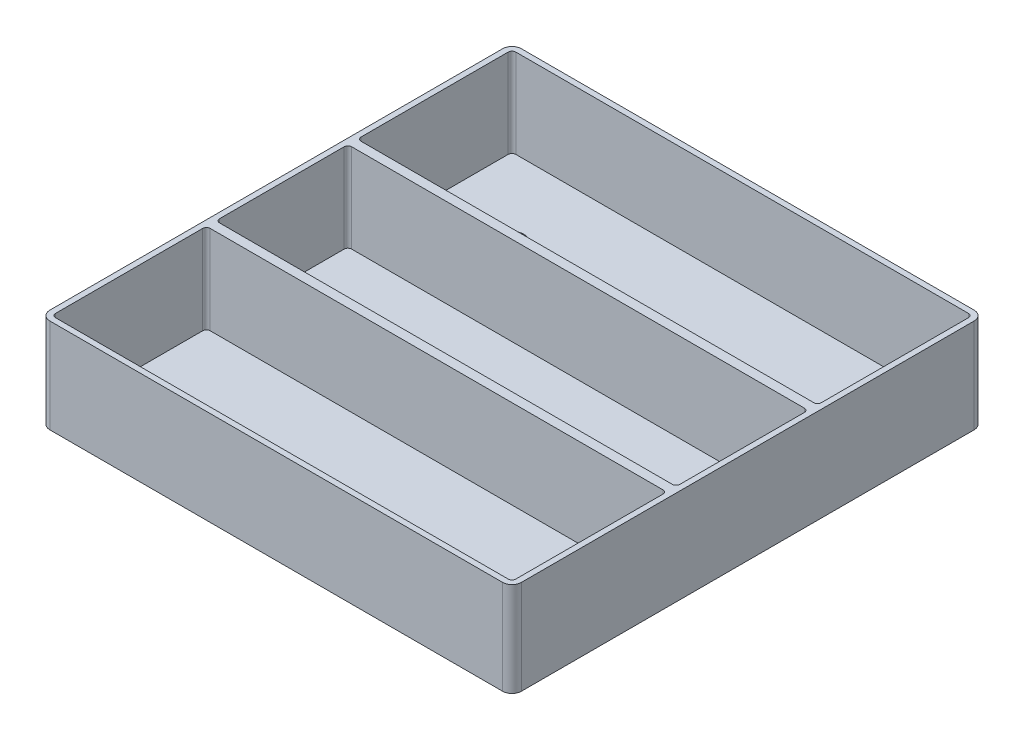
from build123d import *

# Parameters (mm, degrees)
PROFILE_SKETCH_W               = 127
PROFILE_SKETCH_H               = 127
EXTRUDE1_DEPTH                 = 25.4
FILLET1_R                      = 2.54
SHELL3_T                       = -1.524
RIB11_REACH                    = 95.326
RIB_SKETCH_FOR_POCKETS_WALLS_W = 312.6031184
RIB_SKETCH_FOR_POCKETS_WALLS_H = 2.54
FILLET2_R                      = 1.016
HOLES_SKETCH_R                 = 3.175
CUT_EXTRUDE2_DEPTH             = 93.922351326


with BuildPart() as part:
    # Profile Sketch → Extrude1 (new body)
    with BuildSketch(Plane(origin=(0, 0, 0), x_dir=(1, 0, 0), z_dir=(0, 1, 0))):
        Rectangle(PROFILE_SKETCH_W, PROFILE_SKETCH_H)
    extrude(amount=EXTRUDE1_DEPTH)

    # Fillet1
    fillet1_edges = [part.edges().sort_by_distance(p)[0] for p in [
        (-63.5, 12.7, -63.5),
        (63.5, 12.7, -63.5),
        (63.5, 12.7, 63.5),
        (-63.5, 12.7, 63.5),
    ]]
    fillet(fillet1_edges, radius=FILLET1_R)

    # Shell3
    shell3_openings = [part.faces().sort_by_distance(p)[0] for p in [
        (0, 25.4, 0),
    ]]
    offset(amount=SHELL3_T, openings=shell3_openings, kind=Kind.INTERSECTION)

    # Rib Sketch for Pockets walls → Rib11 (add, up to next)
    with BuildSketch(Plane(origin=(0, 25.4, 0), x_dir=(-1, 0, 0), z_dir=(0, 1, 0)), mode=Mode.PRIVATE) as rib11_sk1:
        with Locations((0, -19.05)):
            Rectangle(RIB_SKETCH_FOR_POCKETS_WALLS_W, RIB_SKETCH_FOR_POCKETS_WALLS_H)
    rib11_tool1 = extrude(rib11_sk1.sketch, amount=-RIB11_REACH, mode=Mode.PRIVATE) - part.part
    # Rib Sketch for Pockets walls → Rib11 (add, up to next)
    with BuildSketch(Plane(origin=(0, 25.4, 0), x_dir=(-1, 0, 0), z_dir=(0, 1, 0)), mode=Mode.PRIVATE) as rib11_sk2:
        with Locations((0, 19.05)):
            Rectangle(RIB_SKETCH_FOR_POCKETS_WALLS_W, RIB_SKETCH_FOR_POCKETS_WALLS_H)
    rib11_tool2 = extrude(rib11_sk2.sketch, amount=-RIB11_REACH, mode=Mode.PRIVATE) - part.part
    add(rib11_tool1.solids().sort_by_distance((0, 25.4, -19.05))[0])
    add(rib11_tool2.solids().sort_by_distance((0, 25.4, 19.05))[0])

    # Fillet2
    fillet2_edges = [part.edges().sort_by_distance(p)[0] for p in [
        (61.976, 13.462, 20.32),
        (-61.976, 13.462, 20.32),
        (61.976, 13.462, 17.78),
        (-61.976, 13.462, 17.78),
        (-61.976, 13.462, -20.32),
        (61.976, 13.462, -20.32),
        (-61.976, 13.462, -17.78),
        (61.976, 13.462, -17.78),
    ]]
    fillet(fillet2_edges, radius=FILLET2_R)

    # Holes Sketch → Cut-Extrude2 (cut, through all)
    with BuildSketch(Plane(origin=(0, 1.524, 0), x_dir=(-1, 0, 0), z_dir=(0, 1, 0))):
        with Locations(Location((-44.45, -41.275, 0), (0, 0, 90))):
            Circle(HOLES_SKETCH_R)
        with Locations(Location((41.275, -41.275, 0), (0, 0, 90))):
            Circle(HOLES_SKETCH_R)
        with Locations(Location((-44.45, 41.275, 0), (0, 0, 90))):
            Circle(HOLES_SKETCH_R)
        with Locations(Location((41.275, 41.275, 0), (0, 0, 90))):
            Circle(HOLES_SKETCH_R)
    extrude(amount=-CUT_EXTRUDE2_DEPTH, mode=Mode.SUBTRACT)


solid = part.part
